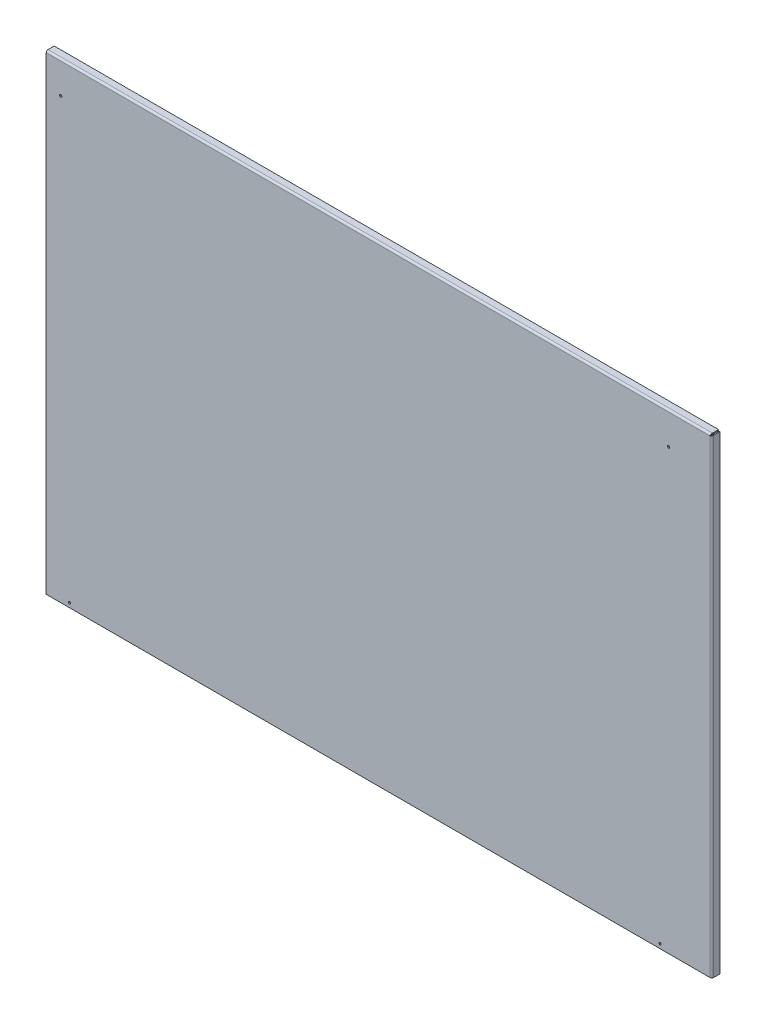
ISO-10303-21;
HEADER;
FILE_DESCRIPTION(('STEP AP214'),'2;1');
FILE_NAME('part.step','',(''),(''),'','','');
FILE_SCHEMA(('AUTOMOTIVE_DESIGN { 1 0 10303 214 1 1 1 1 }'));
ENDSEC;
DATA;
#1=APPLICATION_CONTEXT('core data for automotive mechanical design processes');
#2=APPLICATION_PROTOCOL_DEFINITION('international standard','automotive_design',2000,#1);
#3=PRODUCT_CONTEXT('',#1,'mechanical');
#4=PRODUCT('Part','Part','',(#3));
#5=PRODUCT_RELATED_PRODUCT_CATEGORY('part','',(#4));
#6=PRODUCT_DEFINITION_FORMATION('','',#4);
#7=PRODUCT_DEFINITION_CONTEXT('part definition',#1,'design');
#8=PRODUCT_DEFINITION('design','',#6,#7);
#9=PRODUCT_DEFINITION_SHAPE('','',#8);
#10=(LENGTH_UNIT() NAMED_UNIT(*) SI_UNIT(.MILLI.,.METRE.));
#11=(NAMED_UNIT(*) PLANE_ANGLE_UNIT() SI_UNIT($,.RADIAN.));
#12=(NAMED_UNIT(*) SI_UNIT($,.STERADIAN.) SOLID_ANGLE_UNIT());
#13=UNCERTAINTY_MEASURE_WITH_UNIT(LENGTH_MEASURE(1.E-05),#10,'distance_accuracy_value','');
#14=(GEOMETRIC_REPRESENTATION_CONTEXT(3) GLOBAL_UNCERTAINTY_ASSIGNED_CONTEXT((#13)) GLOBAL_UNIT_ASSIGNED_CONTEXT((#10,
#11,#12)) REPRESENTATION_CONTEXT('',''));
#15=CARTESIAN_POINT('',(0.,0.,0.));
#16=DIRECTION('',(0.,0.,1.));
#17=DIRECTION('',(1.,0.,0.));
#18=AXIS2_PLACEMENT_3D('',#15,#16,#17);
#19=CARTESIAN_POINT('',(0.,0.,-1.5));
#20=DIRECTION('',(0.,0.,1.));
#21=DIRECTION('',(1.,0.,0.));
#22=AXIS2_PLACEMENT_3D('',#19,#20,#21);
#23=PLANE('',#22);
#24=CARTESIAN_POINT('',(-420.,281.1,-1.5));
#25=DIRECTION('',(0.,0.,1.));
#26=DIRECTION('',(1.,0.,0.));
#27=AXIS2_PLACEMENT_3D('',#24,#25,#26);
#28=CIRCLE('',#27,1.50000000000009);
#29=CARTESIAN_POINT('',(-418.5,281.1,-1.5));
#30=VERTEX_POINT('',#29);
#31=EDGE_CURVE('E279',#30,#30,#28,.T.);
#32=ORIENTED_EDGE('',*,*,#31,.T.);
#33=EDGE_LOOP('',(#32));
#34=FACE_BOUND('',#33,.T.);
#35=CARTESIAN_POINT('',(420.,281.1,-1.5));
#36=DIRECTION('',(0.,0.,1.));
#37=DIRECTION('',(1.,0.,0.));
#38=AXIS2_PLACEMENT_3D('',#35,#36,#37);
#39=CIRCLE('',#38,1.50000000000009);
#40=CARTESIAN_POINT('',(421.5,281.1,-1.5));
#41=VERTEX_POINT('',#40);
#42=EDGE_CURVE('E283',#41,#41,#39,.T.);
#43=ORIENTED_EDGE('',*,*,#42,.T.);
#44=EDGE_LOOP('',(#43));
#45=FACE_BOUND('',#44,.T.);
#46=CARTESIAN_POINT('',(-408.,-319.3,-1.5));
#47=DIRECTION('',(0.,0.,1.));
#48=DIRECTION('',(1.,0.,0.));
#49=AXIS2_PLACEMENT_3D('',#46,#47,#48);
#50=CIRCLE('',#49,1.50000000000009);
#51=CARTESIAN_POINT('',(-406.5,-319.3,-1.5));
#52=VERTEX_POINT('',#51);
#53=EDGE_CURVE('E287',#52,#52,#50,.T.);
#54=ORIENTED_EDGE('',*,*,#53,.T.);
#55=EDGE_LOOP('',(#54));
#56=FACE_BOUND('',#55,.T.);
#57=CARTESIAN_POINT('',(408.,-319.3,-1.5));
#58=DIRECTION('',(0.,0.,1.));
#59=DIRECTION('',(1.,0.,0.));
#60=AXIS2_PLACEMENT_3D('',#57,#58,#59);
#61=CIRCLE('',#60,1.50000000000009);
#62=CARTESIAN_POINT('',(409.5,-319.3,-1.5));
#63=VERTEX_POINT('',#62);
#64=EDGE_CURVE('E291',#63,#63,#61,.T.);
#65=ORIENTED_EDGE('',*,*,#64,.T.);
#66=EDGE_LOOP('',(#65));
#67=FACE_BOUND('',#66,.T.);
#68=DIRECTION('',(1.,0.,0.));
#69=VECTOR('',#68,1.);
#70=CARTESIAN_POINT('',(-479.6,-325.3,-1.5));
#71=LINE('',#70,#69);
#72=CARTESIAN_POINT('',(-440.,-325.3,-1.5));
#73=VERTEX_POINT('',#72);
#74=CARTESIAN_POINT('',(477.1,-325.3,-1.49999999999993));
#75=VERTEX_POINT('',#74);
#76=EDGE_CURVE('E13',#73,#75,#71,.T.);
#77=ORIENTED_EDGE('',*,*,#76,.F.);
#78=DIRECTION('',(0.,1.,0.));
#79=VECTOR('',#78,1.);
#80=CARTESIAN_POINT('',(-440.,0.,-1.5));
#81=LINE('',#80,#79);
#82=CARTESIAN_POINT('',(-440.,322.8,-1.50000000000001));
#83=VERTEX_POINT('',#82);
#84=EDGE_CURVE('E296',#73,#83,#81,.T.);
#85=ORIENTED_EDGE('',*,*,#84,.T.);
#86=DIRECTION('',(1.,0.,0.));
#87=VECTOR('',#86,1.);
#88=CARTESIAN_POINT('',(477.958578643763,322.8,-1.50000000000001));
#89=LINE('',#88,#87);
#90=CARTESIAN_POINT('',(477.1,322.8,-1.50000000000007));
#91=VERTEX_POINT('',#90);
#92=EDGE_CURVE('E225',#91,#83,#89,.F.);
#93=ORIENTED_EDGE('',*,*,#92,.F.);
#94=DIRECTION('',(0.,-1.,0.));
#95=VECTOR('',#94,1.);
#96=CARTESIAN_POINT('',(477.1,-325.3,-1.49999999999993));
#97=LINE('',#96,#95);
#98=EDGE_CURVE('E297',#75,#91,#97,.F.);
#99=ORIENTED_EDGE('',*,*,#98,.F.);
#100=EDGE_LOOP('',(#77,#85,#93,#99));
#101=FACE_BOUND('',#100,.T.);
#102=ADVANCED_FACE('F99',(#34,#45,#56,#67,#101),#23,.F.);
#103=CARTESIAN_POINT('',(0.,0.,0.));
#104=DIRECTION('',(0.,0.,1.));
#105=DIRECTION('',(1.,0.,0.));
#106=AXIS2_PLACEMENT_3D('',#103,#104,#105);
#107=PLANE('',#106);
#108=DIRECTION('',(0.,1.,0.));
#109=VECTOR('',#108,1.);
#110=CARTESIAN_POINT('',(-440.,0.,0.));
#111=LINE('',#110,#109);
#112=CARTESIAN_POINT('',(-440.,-325.3,0.));
#113=VERTEX_POINT('',#112);
#114=CARTESIAN_POINT('',(-440.,322.8,0.));
#115=VERTEX_POINT('',#114);
#116=EDGE_CURVE('E429',#113,#115,#111,.T.);
#117=ORIENTED_EDGE('',*,*,#116,.F.);
#118=DIRECTION('',(1.,0.,0.));
#119=VECTOR('',#118,1.);
#120=CARTESIAN_POINT('',(-479.6,-325.3,0.));
#121=LINE('',#120,#119);
#122=CARTESIAN_POINT('',(477.1,-325.3,0.));
#123=VERTEX_POINT('',#122);
#124=EDGE_CURVE('E108',#113,#123,#121,.T.);
#125=ORIENTED_EDGE('',*,*,#124,.T.);
#126=DIRECTION('',(0.,-1.,0.));
#127=VECTOR('',#126,1.);
#128=CARTESIAN_POINT('',(477.1,-325.3,0.));
#129=LINE('',#128,#127);
#130=CARTESIAN_POINT('',(477.1,322.8,0.));
#131=VERTEX_POINT('',#130);
#132=EDGE_CURVE('E329',#123,#131,#129,.F.);
#133=ORIENTED_EDGE('',*,*,#132,.T.);
#134=DIRECTION('',(1.,0.,0.));
#135=VECTOR('',#134,1.);
#136=CARTESIAN_POINT('',(477.958578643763,322.8,0.));
#137=LINE('',#136,#135);
#138=EDGE_CURVE('E230',#131,#115,#137,.F.);
#139=ORIENTED_EDGE('',*,*,#138,.T.);
#140=EDGE_LOOP('',(#117,#125,#133,#139));
#141=FACE_BOUND('',#140,.T.);
#142=CARTESIAN_POINT('',(-420.,281.1,0.));
#143=DIRECTION('',(0.,0.,1.));
#144=DIRECTION('',(1.,0.,0.));
#145=AXIS2_PLACEMENT_3D('',#142,#143,#144);
#146=CIRCLE('',#145,1.50000000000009);
#147=CARTESIAN_POINT('',(-418.5,281.1,0.));
#148=VERTEX_POINT('',#147);
#149=EDGE_CURVE('E103',#148,#148,#146,.T.);
#150=ORIENTED_EDGE('',*,*,#149,.F.);
#151=EDGE_LOOP('',(#150));
#152=FACE_BOUND('',#151,.T.);
#153=CARTESIAN_POINT('',(420.,281.1,0.));
#154=DIRECTION('',(0.,0.,1.));
#155=DIRECTION('',(1.,0.,0.));
#156=AXIS2_PLACEMENT_3D('',#153,#154,#155);
#157=CIRCLE('',#156,1.50000000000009);
#158=CARTESIAN_POINT('',(421.5,281.1,0.));
#159=VERTEX_POINT('',#158);
#160=EDGE_CURVE('E421',#159,#159,#157,.T.);
#161=ORIENTED_EDGE('',*,*,#160,.F.);
#162=EDGE_LOOP('',(#161));
#163=FACE_BOUND('',#162,.T.);
#164=CARTESIAN_POINT('',(-408.,-319.3,0.));
#165=DIRECTION('',(0.,0.,1.));
#166=DIRECTION('',(1.,0.,0.));
#167=AXIS2_PLACEMENT_3D('',#164,#165,#166);
#168=CIRCLE('',#167,1.50000000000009);
#169=CARTESIAN_POINT('',(-406.5,-319.3,0.));
#170=VERTEX_POINT('',#169);
#171=EDGE_CURVE('E423',#170,#170,#168,.T.);
#172=ORIENTED_EDGE('',*,*,#171,.F.);
#173=EDGE_LOOP('',(#172));
#174=FACE_BOUND('',#173,.T.);
#175=CARTESIAN_POINT('',(408.,-319.3,0.));
#176=DIRECTION('',(0.,0.,1.));
#177=DIRECTION('',(1.,0.,0.));
#178=AXIS2_PLACEMENT_3D('',#175,#176,#177);
#179=CIRCLE('',#178,1.50000000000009);
#180=CARTESIAN_POINT('',(409.5,-319.3,0.));
#181=VERTEX_POINT('',#180);
#182=EDGE_CURVE('E425',#181,#181,#179,.T.);
#183=ORIENTED_EDGE('',*,*,#182,.F.);
#184=EDGE_LOOP('',(#183));
#185=FACE_BOUND('',#184,.T.);
#186=ADVANCED_FACE('F270',(#141,#152,#163,#174,#185),#107,.T.);
#187=CARTESIAN_POINT('',(-479.6,-325.3,-1.5));
#188=DIRECTION('',(0.,-1.,0.));
#189=DIRECTION('',(0.,0.,-1.));
#190=AXIS2_PLACEMENT_3D('',#187,#188,#189);
#191=PLANE('',#190);
#192=DIRECTION('',(0.,0.,1.));
#193=VECTOR('',#192,1.);
#194=CARTESIAN_POINT('',(-440.,-325.3,-1.5));
#195=LINE('',#194,#193);
#196=EDGE_CURVE('E303',#73,#113,#195,.T.);
#197=ORIENTED_EDGE('',*,*,#196,.F.);
#198=ORIENTED_EDGE('',*,*,#76,.T.);
#199=DIRECTION('',(0.,0.,1.));
#200=VECTOR('',#199,1.);
#201=CARTESIAN_POINT('',(477.1,-325.3,-1.49999999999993));
#202=LINE('',#201,#200);
#203=EDGE_CURVE('E224',#75,#123,#202,.T.);
#204=ORIENTED_EDGE('',*,*,#203,.T.);
#205=ORIENTED_EDGE('',*,*,#124,.F.);
#206=EDGE_LOOP('',(#197,#198,#204,#205));
#207=FACE_BOUND('',#206,.T.);
#208=ADVANCED_FACE('F101',(#207),#191,.T.);
#209=CARTESIAN_POINT('',(477.958578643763,325.315,-2.49999999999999));
#210=CARTESIAN_POINT('',(477.887018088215,325.315,-2.17073057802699));
#211=CARTESIAN_POINT('',(477.815482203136,325.249541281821,-1.8417040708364));
#212=CARTESIAN_POINT('',(477.672385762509,324.997572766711,-1.23339826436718));
#213=CARTESIAN_POINT('',(477.600837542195,324.811162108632,-0.95441499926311));
#214=CARTESIAN_POINT('',(477.457741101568,324.345585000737,-0.488837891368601));
#215=CARTESIAN_POINT('',(477.386192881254,324.066601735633,-0.302427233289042));
#216=CARTESIAN_POINT('',(477.243096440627,323.458295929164,-0.0504587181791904));
#217=CARTESIAN_POINT('',(477.171560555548,323.129269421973,0.0149999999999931));
#218=CARTESIAN_POINT('',(477.1,322.8,0.0149999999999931));
#219=CARTESIAN_POINT('',(477.958578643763,325.3,-2.49999999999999));
#220=CARTESIAN_POINT('',(477.887018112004,325.3,-2.17269445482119));
#221=CARTESIAN_POINT('',(477.815482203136,325.234931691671,-1.84563028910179));
#222=CARTESIAN_POINT('',(477.672385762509,324.984465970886,-1.24095254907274));
#223=CARTESIAN_POINT('',(477.600837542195,324.799167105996,-0.963633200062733));
#224=CARTESIAN_POINT('',(477.457741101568,324.336366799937,-0.500832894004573));
#225=CARTESIAN_POINT('',(477.386192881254,324.059047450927,-0.315534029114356));
#226=CARTESIAN_POINT('',(477.243096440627,323.454369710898,-0.0650683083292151));
#227=CARTESIAN_POINT('',(477.171560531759,323.127305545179,0.));
#228=CARTESIAN_POINT('',(477.1,322.8,0.));
#229=CARTESIAN_POINT('',(477.958578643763,323.8,-2.5));
#230=CARTESIAN_POINT('',(477.887020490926,323.8,-2.36908213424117));
#231=CARTESIAN_POINT('',(477.815482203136,323.773972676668,-2.23825211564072));
#232=CARTESIAN_POINT('',(477.672385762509,323.673786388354,-1.9963810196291));
#233=CARTESIAN_POINT('',(477.600837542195,323.599666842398,-1.88545328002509));
#234=CARTESIAN_POINT('',(477.457741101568,323.414546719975,-1.70033315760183));
#235=CARTESIAN_POINT('',(477.386192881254,323.303618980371,-1.62621361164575));
#236=CARTESIAN_POINT('',(477.243096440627,323.061747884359,-1.52602732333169));
#237=CARTESIAN_POINT('',(477.171558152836,322.930917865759,-1.50000000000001));
#238=CARTESIAN_POINT('',(477.1,322.8,-1.50000000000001));
#239=CARTESIAN_POINT('',(477.958578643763,323.78485,-2.5));
#240=CARTESIAN_POINT('',(477.887020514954,323.78485,-2.37106564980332));
#241=CARTESIAN_POINT('',(477.815482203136,323.759216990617,-2.24221759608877));
#242=CARTESIAN_POINT('',(477.672385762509,323.660548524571,-2.00401084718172));
#243=CARTESIAN_POINT('',(477.600837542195,323.587551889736,-1.89476366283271));
#244=CARTESIAN_POINT('',(477.457741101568,323.405236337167,-1.71244811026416));
#245=CARTESIAN_POINT('',(477.386192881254,323.295989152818,-1.63945147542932));
#246=CARTESIAN_POINT('',(477.243096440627,323.057782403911,-1.54078300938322));
#247=CARTESIAN_POINT('',(477.171558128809,322.928934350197,-1.51515000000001));
#248=CARTESIAN_POINT('',(477.1,322.8,-1.51515000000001));
#249=B_SPLINE_SURFACE_WITH_KNOTS('',1,3,((#209,#210,#211,#212,#213,#214,#215,#216,#217,#218),
(#219,#220,#221,#222,#223,#224,#225,#226,#227,#228),(#229,#230,#231,#232,#233,#234,#235,#236,
#237,#238),(#239,#240,#241,#242,#243,#244,#245,#246,#247,#248)),.UNSPECIFIED.,.F.,.F.,.F.,(2,1,
1,2),(4,2,2,2,4),(-0.01,0.,1.,1.0101),(0.,0.25,0.5,0.75,1.),.UNSPECIFIED.);
#250=CARTESIAN_POINT('',(477.958578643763,323.8,-2.5));
#251=CARTESIAN_POINT('',(477.938038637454,323.800009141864,-2.46242402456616));
#252=CARTESIAN_POINT('',(477.917500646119,323.797882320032,-2.42485010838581));
#253=CARTESIAN_POINT('',(477.876424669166,323.789424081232,-2.35017596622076));
#254=CARTESIAN_POINT('',(477.855886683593,323.783092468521,-2.31307576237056));
#255=CARTESIAN_POINT('',(477.814858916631,323.766312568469,-2.23991192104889));
#256=CARTESIAN_POINT('',(477.794369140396,323.755874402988,-2.20384596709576));
#257=CARTESIAN_POINT('',(477.753398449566,323.7310270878,-2.13312857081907));
#258=CARTESIAN_POINT('',(477.732917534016,323.716618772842,-2.09847683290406));
#259=CARTESIAN_POINT('',(477.67735968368,323.672369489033,-2.00697056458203));
#260=CARTESIAN_POINT('',(477.642264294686,323.63884162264,-1.95185780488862));
#261=CARTESIAN_POINT('',(477.572112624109,323.561901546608,-1.84913372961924));
#262=CARTESIAN_POINT('',(477.537056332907,323.518496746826,-1.80151683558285));
#263=CARTESIAN_POINT('',(477.466949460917,323.423386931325,-1.71546320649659));
#264=CARTESIAN_POINT('',(477.431898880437,323.371683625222,-1.67702458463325));
#265=CARTESIAN_POINT('',(477.361781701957,323.261860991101,-1.61072965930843));
#266=CARTESIAN_POINT('',(477.326715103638,323.203738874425,-1.58287797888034));
#267=CARTESIAN_POINT('',(477.259694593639,323.088584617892,-1.54076358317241));
#268=CARTESIAN_POINT('',(477.2277407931,323.03191401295,-1.52551378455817));
#269=CARTESIAN_POINT('',(477.179839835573,322.945619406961,-1.51022659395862));
#270=CARTESIAN_POINT('',(477.163874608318,322.916633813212,-1.50639544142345));
#271=CARTESIAN_POINT('',(477.131941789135,322.858435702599,-1.50128162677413));
#272=CARTESIAN_POINT('',(477.115974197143,322.829223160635,-1.49999925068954));
#273=CARTESIAN_POINT('',(477.1,322.8,-1.50000000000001));
#274=B_SPLINE_CURVE_WITH_KNOTS('',3,(#250,#251,#252,#253,#254,#255,#256,#257,#258,#259,#260,
#261,#262,#263,#264,#265,#266,#267,#268,#269,#270,#271,#272,#273),.UNSPECIFIED.,.F.,.F.,(4,2,2,
2,2,2,2,2,2,2,2,4),(0.,0.128412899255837,0.256831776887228,0.384936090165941,0.513013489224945,
0.732204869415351,0.95123234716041,1.17021475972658,1.38929268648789,1.58891634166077,
1.68876822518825,1.78863131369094),.UNSPECIFIED.);
#275=CARTESIAN_POINT('',(477.958578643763,323.8,-2.5));
#276=VERTEX_POINT('',#275);
#277=EDGE_CURVE('E229',#276,#91,#274,.T.);
#278=DIRECTION('',(0.,1.,0.));
#279=VECTOR('',#278,1.);
#280=CARTESIAN_POINT('',(477.958578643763,323.8,-2.5));
#281=LINE('',#280,#279);
#282=CARTESIAN_POINT('',(477.958578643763,325.3,-2.49999999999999));
#283=VERTEX_POINT('',#282);
#284=EDGE_CURVE('E212',#283,#276,#281,.F.);
#285=CARTESIAN_POINT('',(477.958578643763,325.3,-2.49999999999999));
#286=CARTESIAN_POINT('',(477.944918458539,325.300000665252,-2.43752341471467));
#287=CARTESIAN_POINT('',(477.931262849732,325.29765716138,-2.37506713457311));
#288=CARTESIAN_POINT('',(477.903953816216,325.288304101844,-2.25051293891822));
#289=CARTESIAN_POINT('',(477.890300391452,325.281295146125,-2.18841497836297));
#290=CARTESIAN_POINT('',(477.849336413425,325.253308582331,-2.00315044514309));
#291=CARTESIAN_POINT('',(477.822013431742,325.22537124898,-1.88097287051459));
#292=CARTESIAN_POINT('',(477.763226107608,325.145951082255,-1.62408862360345));
#293=CARTESIAN_POINT('',(477.731760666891,325.091545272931,-1.49028327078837));
#294=CARTESIAN_POINT('',(477.668833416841,324.960548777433,-1.23400616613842));
#295=CARTESIAN_POINT('',(477.637371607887,324.88395661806,-1.11153516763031));
#296=CARTESIAN_POINT('',(477.574445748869,324.71087175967,-0.881581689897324));
#297=CARTESIAN_POINT('',(477.542981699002,324.614380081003,-0.774098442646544));
#298=CARTESIAN_POINT('',(477.480051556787,324.404347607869,-0.57729894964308));
#299=CARTESIAN_POINT('',(477.448585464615,324.290804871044,-0.487984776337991));
#300=CARTESIAN_POINT('',(477.385649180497,324.050049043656,-0.330183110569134));
#301=CARTESIAN_POINT('',(477.354178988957,323.922833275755,-0.261699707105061));
#302=CARTESIAN_POINT('',(477.291243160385,323.658544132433,-0.147641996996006));
#303=CARTESIAN_POINT('',(477.259777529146,323.521475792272,-0.10205608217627));
#304=CARTESIAN_POINT('',(477.206924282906,323.286364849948,-0.0458089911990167));
#305=CARTESIAN_POINT('',(477.18552534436,323.189828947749,-0.0286447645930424));
#306=CARTESIAN_POINT('',(477.142754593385,322.995541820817,-0.00573935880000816));
#307=CARTESIAN_POINT('',(477.121382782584,322.897792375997,1.69267853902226E-05));
#308=CARTESIAN_POINT('',(477.1,322.8,0.));
#309=B_SPLINE_CURVE_WITH_KNOTS('',3,(#285,#286,#287,#288,#289,#290,#291,#292,#293,#294,#295,
#296,#297,#298,#299,#300,#301,#302,#303,#304,#305,#306,#307,#308),.UNSPECIFIED.,.F.,.F.,(4,2,2,
2,2,2,2,2,2,2,2,4),(0.,0.191773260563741,0.383521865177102,0.766896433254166,1.20827746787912,
1.64968781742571,2.09107553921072,2.53251357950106,2.97403821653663,3.41533879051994,
3.71579434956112,4.0158517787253),.UNSPECIFIED.);
#310=EDGE_CURVE('E228',#283,#131,#309,.T.);
#311=DIRECTION('',(0.,0.,1.));
#312=VECTOR('',#311,1.);
#313=CARTESIAN_POINT('',(477.1,322.8,-1.50000000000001));
#314=LINE('',#313,#312);
#315=EDGE_CURVE('E233',#91,#131,#314,.T.);
#316=ORIENTED_EDGE('',*,*,#277,.F.);
#317=ORIENTED_EDGE('',*,*,#284,.F.);
#318=ORIENTED_EDGE('',*,*,#310,.T.);
#319=ORIENTED_EDGE('',*,*,#315,.F.);
#320=EDGE_LOOP('',(#316,#317,#318,#319));
#321=FACE_BOUND('',#320,.T.);
#322=ADVANCED_FACE('F248',(#321),#249,.F.);
#323=CARTESIAN_POINT('',(477.958578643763,322.8,-2.50000000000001));
#324=DIRECTION('',(1.,0.,0.));
#325=DIRECTION('',(0.,1.,0.));
#326=AXIS2_PLACEMENT_3D('',#323,#324,#325);
#327=CYLINDRICAL_SURFACE('',#326,2.5);
#328=CARTESIAN_POINT('',(-440.,322.8,-2.50000000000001));
#329=DIRECTION('',(1.,0.,0.));
#330=DIRECTION('',(0.,1.,0.));
#331=AXIS2_PLACEMENT_3D('',#328,#329,#330);
#332=CIRCLE('',#331,2.5);
#333=CARTESIAN_POINT('',(-440.,325.3,-2.50000000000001));
#334=VERTEX_POINT('',#333);
#335=EDGE_CURVE('E427',#115,#334,#332,.F.);
#336=ORIENTED_EDGE('',*,*,#335,.F.);
#337=ORIENTED_EDGE('',*,*,#138,.F.);
#338=ORIENTED_EDGE('',*,*,#310,.F.);
#339=DIRECTION('',(1.,0.,0.));
#340=VECTOR('',#339,1.);
#341=CARTESIAN_POINT('',(0.,325.3,-2.49999999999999));
#342=LINE('',#341,#340);
#343=EDGE_CURVE('E210',#334,#283,#342,.T.);
#344=ORIENTED_EDGE('',*,*,#343,.F.);
#345=EDGE_LOOP('',(#336,#337,#338,#344));
#346=FACE_BOUND('',#345,.T.);
#347=ADVANCED_FACE('F253',(#346),#327,.T.);
#348=CARTESIAN_POINT('',(477.958578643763,322.8,-2.50000000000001));
#349=DIRECTION('',(1.,0.,0.));
#350=DIRECTION('',(0.,1.,0.));
#351=AXIS2_PLACEMENT_3D('',#348,#349,#350);
#352=CYLINDRICAL_SURFACE('',#351,1.);
#353=ORIENTED_EDGE('',*,*,#92,.T.);
#354=CARTESIAN_POINT('',(-440.,322.8,-2.50000000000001));
#355=DIRECTION('',(1.,0.,0.));
#356=DIRECTION('',(0.,1.,0.));
#357=AXIS2_PLACEMENT_3D('',#354,#355,#356);
#358=CIRCLE('',#357,1.);
#359=CARTESIAN_POINT('',(-440.,323.8,-2.5));
#360=VERTEX_POINT('',#359);
#361=EDGE_CURVE('E203',#83,#360,#358,.F.);
#362=ORIENTED_EDGE('',*,*,#361,.T.);
#363=DIRECTION('',(-1.,0.,0.));
#364=VECTOR('',#363,1.);
#365=CARTESIAN_POINT('',(-479.6,323.8,-2.5));
#366=LINE('',#365,#364);
#367=EDGE_CURVE('E202',#360,#276,#366,.F.);
#368=ORIENTED_EDGE('',*,*,#367,.T.);
#369=ORIENTED_EDGE('',*,*,#277,.T.);
#370=EDGE_LOOP('',(#353,#362,#368,#369));
#371=FACE_BOUND('',#370,.T.);
#372=ADVANCED_FACE('F257',(#371),#352,.F.);
#373=CARTESIAN_POINT('',(0.,325.3,1.90605590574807E-12));
#374=DIRECTION('',(0.,1.,0.));
#375=DIRECTION('',(0.,0.,1.));
#376=AXIS2_PLACEMENT_3D('',#373,#374,#375);
#377=PLANE('',#376);
#378=DIRECTION('',(0.,0.,-1.));
#379=VECTOR('',#378,1.);
#380=CARTESIAN_POINT('',(-440.,325.3,1.90605590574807E-12));
#381=LINE('',#380,#379);
#382=CARTESIAN_POINT('',(-440.,325.3,-11.));
#383=VERTEX_POINT('',#382);
#384=EDGE_CURVE('E116',#334,#383,#381,.T.);
#385=ORIENTED_EDGE('',*,*,#384,.F.);
#386=ORIENTED_EDGE('',*,*,#343,.T.);
#387=DIRECTION('',(0.,0.,-1.));
#388=VECTOR('',#387,1.);
#389=CARTESIAN_POINT('',(477.958578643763,325.3,-1.49999999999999));
#390=LINE('',#389,#388);
#391=CARTESIAN_POINT('',(477.958578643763,325.3,-11.));
#392=VERTEX_POINT('',#391);
#393=EDGE_CURVE('E219',#392,#283,#390,.F.);
#394=ORIENTED_EDGE('',*,*,#393,.F.);
#395=DIRECTION('',(1.,0.,0.));
#396=VECTOR('',#395,1.);
#397=CARTESIAN_POINT('',(479.6,325.3,-11.));
#398=LINE('',#397,#396);
#399=EDGE_CURVE('E209',#383,#392,#398,.T.);
#400=ORIENTED_EDGE('',*,*,#399,.F.);
#401=EDGE_LOOP('',(#385,#386,#394,#400));
#402=FACE_BOUND('',#401,.T.);
#403=ADVANCED_FACE('F262',(#402),#377,.T.);
#404=CARTESIAN_POINT('',(0.,323.8,1.90081868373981E-12));
#405=DIRECTION('',(0.,1.,0.));
#406=DIRECTION('',(0.,0.,1.));
#407=AXIS2_PLACEMENT_3D('',#404,#405,#406);
#408=PLANE('',#407);
#409=ORIENTED_EDGE('',*,*,#367,.F.);
#410=DIRECTION('',(0.,0.,-1.));
#411=VECTOR('',#410,1.);
#412=CARTESIAN_POINT('',(-440.,323.8,1.90081868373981E-12));
#413=LINE('',#412,#411);
#414=CARTESIAN_POINT('',(-440.,323.8,-11.));
#415=VERTEX_POINT('',#414);
#416=EDGE_CURVE('E190',#360,#415,#413,.T.);
#417=ORIENTED_EDGE('',*,*,#416,.T.);
#418=DIRECTION('',(-1.,0.,0.));
#419=VECTOR('',#418,1.);
#420=CARTESIAN_POINT('',(0.,323.8,-11.));
#421=LINE('',#420,#419);
#422=CARTESIAN_POINT('',(477.958578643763,323.8,-11.));
#423=VERTEX_POINT('',#422);
#424=EDGE_CURVE('E200',#415,#423,#421,.F.);
#425=ORIENTED_EDGE('',*,*,#424,.T.);
#426=DIRECTION('',(0.,0.,-1.));
#427=VECTOR('',#426,1.);
#428=CARTESIAN_POINT('',(477.958578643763,323.8,-1.5));
#429=LINE('',#428,#427);
#430=EDGE_CURVE('E222',#276,#423,#429,.T.);
#431=ORIENTED_EDGE('',*,*,#430,.F.);
#432=EDGE_LOOP('',(#409,#417,#425,#431));
#433=FACE_BOUND('',#432,.T.);
#434=ADVANCED_FACE('F198',(#433),#408,.F.);
#435=CARTESIAN_POINT('',(479.6,325.3,-11.));
#436=DIRECTION('',(0.,0.,-1.));
#437=DIRECTION('',(0.,1.,0.));
#438=AXIS2_PLACEMENT_3D('',#435,#436,#437);
#439=PLANE('',#438);
#440=DIRECTION('',(0.,1.,0.));
#441=VECTOR('',#440,1.);
#442=CARTESIAN_POINT('',(-440.,525.3,-11.));
#443=LINE('',#442,#441);
#444=EDGE_CURVE('E187',#415,#383,#443,.T.);
#445=ORIENTED_EDGE('',*,*,#444,.T.);
#446=ORIENTED_EDGE('',*,*,#399,.T.);
#447=DIRECTION('',(0.,-1.,0.));
#448=VECTOR('',#447,1.);
#449=CARTESIAN_POINT('',(477.958578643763,323.8,-11.));
#450=LINE('',#449,#448);
#451=EDGE_CURVE('E207',#423,#392,#450,.F.);
#452=ORIENTED_EDGE('',*,*,#451,.F.);
#453=ORIENTED_EDGE('',*,*,#424,.F.);
#454=EDGE_LOOP('',(#445,#446,#452,#453));
#455=FACE_BOUND('',#454,.T.);
#456=ADVANCED_FACE('F205',(#455),#439,.T.);
#457=CARTESIAN_POINT('',(477.958578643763,323.8,-1.5));
#458=DIRECTION('',(-1.,0.,0.));
#459=DIRECTION('',(0.,0.,1.));
#460=AXIS2_PLACEMENT_3D('',#457,#458,#459);
#461=PLANE('',#460);
#462=ORIENTED_EDGE('',*,*,#430,.T.);
#463=ORIENTED_EDGE('',*,*,#451,.T.);
#464=ORIENTED_EDGE('',*,*,#393,.T.);
#465=ORIENTED_EDGE('',*,*,#284,.T.);
#466=EDGE_LOOP('',(#462,#463,#464,#465));
#467=FACE_BOUND('',#466,.T.);
#468=ADVANCED_FACE('F484',(#467),#461,.F.);
#469=CARTESIAN_POINT('',(477.1,322.8,0.0149999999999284));
#470=CARTESIAN_POINT('',(477.429269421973,322.871560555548,0.0149999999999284));
#471=CARTESIAN_POINT('',(477.758295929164,322.943096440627,-0.0504587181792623));
#472=CARTESIAN_POINT('',(478.366601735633,323.086192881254,-0.302427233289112));
#473=CARTESIAN_POINT('',(478.645585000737,323.157741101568,-0.488837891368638));
#474=CARTESIAN_POINT('',(479.111162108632,323.300837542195,-0.954414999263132));
#475=CARTESIAN_POINT('',(479.297572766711,323.372385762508,-1.2333982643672));
#476=CARTESIAN_POINT('',(479.549541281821,323.515482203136,-1.84170407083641));
#477=CARTESIAN_POINT('',(479.615,323.587018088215,-2.17073057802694));
#478=CARTESIAN_POINT('',(479.615,323.658578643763,-2.49999999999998));
#479=CARTESIAN_POINT('',(477.1,322.8,0.));
#480=CARTESIAN_POINT('',(477.427305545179,322.871560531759,0.));
#481=CARTESIAN_POINT('',(477.754369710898,322.943096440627,-0.065068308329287));
#482=CARTESIAN_POINT('',(478.359047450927,323.086192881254,-0.315534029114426));
#483=CARTESIAN_POINT('',(478.636366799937,323.157741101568,-0.500832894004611));
#484=CARTESIAN_POINT('',(479.099167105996,323.300837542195,-0.963633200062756));
#485=CARTESIAN_POINT('',(479.284465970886,323.372385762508,-1.24095254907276));
#486=CARTESIAN_POINT('',(479.534931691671,323.515482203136,-1.84563028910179));
#487=CARTESIAN_POINT('',(479.6,323.587018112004,-2.17269445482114));
#488=CARTESIAN_POINT('',(479.6,323.658578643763,-2.49999999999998));
#489=CARTESIAN_POINT('',(477.1,322.8,-1.50000000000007));
#490=CARTESIAN_POINT('',(477.230917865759,322.871558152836,-1.50000000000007));
#491=CARTESIAN_POINT('',(477.361747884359,322.943096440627,-1.52602732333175));
#492=CARTESIAN_POINT('',(477.603618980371,323.086192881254,-1.6262136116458));
#493=CARTESIAN_POINT('',(477.714546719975,323.157741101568,-1.70033315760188));
#494=CARTESIAN_POINT('',(477.899666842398,323.300837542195,-1.88545328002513));
#495=CARTESIAN_POINT('',(477.973786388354,323.372385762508,-1.99638101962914));
#496=CARTESIAN_POINT('',(478.073972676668,323.515482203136,-2.23825211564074));
#497=CARTESIAN_POINT('',(478.1,323.587020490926,-2.36908213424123));
#498=CARTESIAN_POINT('',(478.1,323.658578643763,-2.5));
#499=CARTESIAN_POINT('',(477.1,322.8,-1.51515000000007));
#500=CARTESIAN_POINT('',(477.228934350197,322.871558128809,-1.51515000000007));
#501=CARTESIAN_POINT('',(477.357782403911,322.943096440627,-1.54078300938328));
#502=CARTESIAN_POINT('',(477.595989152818,323.086192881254,-1.63945147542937));
#503=CARTESIAN_POINT('',(477.705236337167,323.157741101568,-1.71244811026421));
#504=CARTESIAN_POINT('',(477.887551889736,323.300837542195,-1.89476366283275));
#505=CARTESIAN_POINT('',(477.960548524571,323.372385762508,-2.00401084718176));
#506=CARTESIAN_POINT('',(478.059216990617,323.515482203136,-2.24221759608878));
#507=CARTESIAN_POINT('',(478.08485,323.587020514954,-2.37106564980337));
#508=CARTESIAN_POINT('',(478.08485,323.658578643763,-2.5));
#509=B_SPLINE_SURFACE_WITH_KNOTS('',1,3,((#469,#470,#471,#472,#473,#474,#475,#476,#477,#478),
(#479,#480,#481,#482,#483,#484,#485,#486,#487,#488),(#489,#490,#491,#492,#493,#494,#495,#496,
#497,#498),(#499,#500,#501,#502,#503,#504,#505,#506,#507,#508)),.UNSPECIFIED.,.F.,.F.,.F.,(2,1,
1,2),(4,2,2,2,4),(-0.01,0.,1.,1.0101),(0.,0.25,0.5,0.75,1.),.UNSPECIFIED.);
#510=DIRECTION('',(-1.,0.,0.));
#511=VECTOR('',#510,1.);
#512=CARTESIAN_POINT('',(478.1,323.658578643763,-2.5));
#513=LINE('',#512,#511);
#514=CARTESIAN_POINT('',(479.6,323.658578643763,-2.50000000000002));
#515=VERTEX_POINT('',#514);
#516=CARTESIAN_POINT('',(478.1,323.658578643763,-2.50000000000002));
#517=VERTEX_POINT('',#516);
#518=EDGE_CURVE('E320',#515,#517,#513,.T.);
#519=CARTESIAN_POINT('',(477.1,322.8,-1.50000000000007));
#520=CARTESIAN_POINT('',(477.137575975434,322.820540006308,-1.49999085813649));
#521=CARTESIAN_POINT('',(477.175149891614,322.841077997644,-1.50211767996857));
#522=CARTESIAN_POINT('',(477.249824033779,322.882153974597,-1.51057591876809));
#523=CARTESIAN_POINT('',(477.28692423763,322.902691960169,-1.51690753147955));
#524=CARTESIAN_POINT('',(477.360088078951,322.943719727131,-1.53368743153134));
#525=CARTESIAN_POINT('',(477.396154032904,322.964209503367,-1.54412559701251));
#526=CARTESIAN_POINT('',(477.466871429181,323.005180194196,-1.56897291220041));
#527=CARTESIAN_POINT('',(477.501523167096,323.025661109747,-1.58338122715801));
#528=CARTESIAN_POINT('',(477.593029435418,323.081218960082,-1.62763051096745));
#529=CARTESIAN_POINT('',(477.648142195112,323.116314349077,-1.66115837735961));
#530=CARTESIAN_POINT('',(477.750866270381,323.186466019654,-1.73809845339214));
#531=CARTESIAN_POINT('',(477.798483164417,323.221522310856,-1.78150325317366));
#532=CARTESIAN_POINT('',(477.884536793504,323.291629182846,-1.87661306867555));
#533=CARTESIAN_POINT('',(477.922975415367,323.326679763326,-1.92831637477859));
#534=CARTESIAN_POINT('',(477.989270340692,323.396796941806,-2.0381390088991));
#535=CARTESIAN_POINT('',(478.01712202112,323.431863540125,-2.09626112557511));
#536=CARTESIAN_POINT('',(478.059236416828,323.498884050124,-2.21141538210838));
#537=CARTESIAN_POINT('',(478.074486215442,323.530837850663,-2.26808598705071));
#538=CARTESIAN_POINT('',(478.089773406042,323.578738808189,-2.35438059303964));
#539=CARTESIAN_POINT('',(478.093604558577,323.594704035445,-2.38336618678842));
#540=CARTESIAN_POINT('',(478.098718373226,323.626636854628,-2.44156429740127));
#541=CARTESIAN_POINT('',(478.100000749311,323.64260444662,-2.47077683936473));
#542=CARTESIAN_POINT('',(478.1,323.658578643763,-2.5));
#543=B_SPLINE_CURVE_WITH_KNOTS('',3,(#519,#520,#521,#522,#523,#524,#525,#526,#527,#528,#529,
#530,#531,#532,#533,#534,#535,#536,#537,#538,#539,#540,#541,#542),.UNSPECIFIED.,.F.,.F.,(4,2,2,
2,2,2,2,2,2,2,2,4),(0.,0.128412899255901,0.256831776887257,0.38493609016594,0.513013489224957,
0.732204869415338,0.951232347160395,1.17021475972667,1.38929268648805,1.58891634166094,
1.68876822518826,1.78863131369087),.UNSPECIFIED.);
#544=EDGE_CURVE('E322',#91,#517,#543,.T.);
#545=CARTESIAN_POINT('',(477.1,322.8,0.));
#546=CARTESIAN_POINT('',(477.162476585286,322.813660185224,6.65252070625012E-07));
#547=CARTESIAN_POINT('',(477.224932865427,322.827315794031,-0.00234283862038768));
#548=CARTESIAN_POINT('',(477.349487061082,322.854624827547,-0.0116958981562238));
#549=CARTESIAN_POINT('',(477.411585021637,322.868278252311,-0.0187048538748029));
#550=CARTESIAN_POINT('',(477.596849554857,322.909242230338,-0.0466914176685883));
#551=CARTESIAN_POINT('',(477.719027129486,322.936565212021,-0.0746287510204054));
#552=CARTESIAN_POINT('',(477.975911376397,322.995352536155,-0.154048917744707));
#553=CARTESIAN_POINT('',(478.109716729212,323.026817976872,-0.208454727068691));
#554=CARTESIAN_POINT('',(478.365993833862,323.089745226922,-0.339451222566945));
#555=CARTESIAN_POINT('',(478.48846483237,323.121207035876,-0.416043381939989));
#556=CARTESIAN_POINT('',(478.718418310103,323.184132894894,-0.589128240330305));
#557=CARTESIAN_POINT('',(478.825901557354,323.215596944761,-0.685619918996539));
#558=CARTESIAN_POINT('',(479.022701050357,323.278527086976,-0.895652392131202));
#559=CARTESIAN_POINT('',(479.112015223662,323.309993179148,-1.00919512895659));
#560=CARTESIAN_POINT('',(479.269816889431,323.372929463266,-1.24995095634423));
#561=CARTESIAN_POINT('',(479.338300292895,323.404399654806,-1.37716672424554));
#562=CARTESIAN_POINT('',(479.452358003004,323.467335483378,-1.641455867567));
#563=CARTESIAN_POINT('',(479.497943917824,323.498801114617,-1.77852420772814));
#564=CARTESIAN_POINT('',(479.554191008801,323.551654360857,-2.01363515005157));
#565=CARTESIAN_POINT('',(479.571355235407,323.573053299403,-2.11017105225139));
#566=CARTESIAN_POINT('',(479.5942606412,323.615824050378,-2.30445817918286));
#567=CARTESIAN_POINT('',(479.600016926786,323.637195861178,-2.40220762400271));
#568=CARTESIAN_POINT('',(479.6,323.658578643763,-2.49999999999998));
#569=B_SPLINE_CURVE_WITH_KNOTS('',3,(#545,#546,#547,#548,#549,#550,#551,#552,#553,#554,#555,
#556,#557,#558,#559,#560,#561,#562,#563,#564,#565,#566,#567,#568),.UNSPECIFIED.,.F.,.F.,(4,2,2,
2,2,2,2,2,2,2,2,4),(0.,0.191773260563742,0.383521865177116,0.766896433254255,1.2082774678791,
1.64968781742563,2.09107553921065,2.532513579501,2.97403821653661,3.41533879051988,
3.71579434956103,4.01585177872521),.UNSPECIFIED.);
#570=EDGE_CURVE('E125',#131,#515,#569,.T.);
#571=ORIENTED_EDGE('',*,*,#518,.T.);
#572=ORIENTED_EDGE('',*,*,#544,.F.);
#573=ORIENTED_EDGE('',*,*,#315,.T.);
#574=ORIENTED_EDGE('',*,*,#570,.T.);
#575=EDGE_LOOP('',(#571,#572,#573,#574));
#576=FACE_BOUND('',#575,.T.);
#577=ADVANCED_FACE('F344',(#576),#509,.F.);
#578=CARTESIAN_POINT('',(477.1,-325.3,-2.49999999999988));
#579=DIRECTION('',(0.,1.,0.));
#580=DIRECTION('',(0.,0.,1.));
#581=AXIS2_PLACEMENT_3D('',#578,#579,#580);
#582=PLANE('',#581);
#583=CARTESIAN_POINT('',(477.1,-325.3,-2.49999999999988));
#584=DIRECTION('',(0.,-1.,0.));
#585=DIRECTION('',(0.,0.,-1.));
#586=AXIS2_PLACEMENT_3D('',#583,#584,#585);
#587=CIRCLE('',#586,0.999999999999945);
#588=CARTESIAN_POINT('',(478.1,-325.3,-2.49999999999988));
#589=VERTEX_POINT('',#588);
#590=EDGE_CURVE('E310',#589,#75,#587,.T.);
#591=ORIENTED_EDGE('',*,*,#590,.F.);
#592=DIRECTION('',(1.,0.,0.));
#593=VECTOR('',#592,1.);
#594=CARTESIAN_POINT('',(478.1,-325.3,-2.49999999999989));
#595=LINE('',#594,#593);
#596=CARTESIAN_POINT('',(479.6,-325.3,-2.49999999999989));
#597=VERTEX_POINT('',#596);
#598=EDGE_CURVE('E391',#589,#597,#595,.T.);
#599=ORIENTED_EDGE('',*,*,#598,.T.);
#600=CARTESIAN_POINT('',(477.1,-325.3,-2.49999999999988));
#601=DIRECTION('',(0.,-1.,0.));
#602=DIRECTION('',(0.,0.,-1.));
#603=AXIS2_PLACEMENT_3D('',#600,#601,#602);
#604=CIRCLE('',#603,2.49999999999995);
#605=EDGE_CURVE('E312',#597,#123,#604,.T.);
#606=ORIENTED_EDGE('',*,*,#605,.T.);
#607=ORIENTED_EDGE('',*,*,#203,.F.);
#608=EDGE_LOOP('',(#591,#599,#606,#607));
#609=FACE_BOUND('',#608,.T.);
#610=ADVANCED_FACE('F308',(#609),#582,.F.);
#611=CARTESIAN_POINT('',(477.1,-325.3,-2.49999999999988));
#612=DIRECTION('',(0.,-1.,0.));
#613=DIRECTION('',(1.,0.,0.));
#614=AXIS2_PLACEMENT_3D('',#611,#612,#613);
#615=CYLINDRICAL_SURFACE('',#614,2.49999999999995);
#616=ORIENTED_EDGE('',*,*,#132,.F.);
#617=ORIENTED_EDGE('',*,*,#605,.F.);
#618=DIRECTION('',(0.,-1.,0.));
#619=VECTOR('',#618,1.);
#620=CARTESIAN_POINT('',(479.6,325.3,-2.5));
#621=LINE('',#620,#619);
#622=EDGE_CURVE('E405',#597,#515,#621,.F.);
#623=ORIENTED_EDGE('',*,*,#622,.T.);
#624=ORIENTED_EDGE('',*,*,#570,.F.);
#625=EDGE_LOOP('',(#616,#617,#623,#624));
#626=FACE_BOUND('',#625,.T.);
#627=ADVANCED_FACE('F349',(#626),#615,.T.);
#628=CARTESIAN_POINT('',(477.1,-325.3,-2.49999999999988));
#629=DIRECTION('',(0.,-1.,0.));
#630=DIRECTION('',(1.,0.,0.));
#631=AXIS2_PLACEMENT_3D('',#628,#629,#630);
#632=CYLINDRICAL_SURFACE('',#631,0.999999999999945);
#633=ORIENTED_EDGE('',*,*,#98,.T.);
#634=ORIENTED_EDGE('',*,*,#544,.T.);
#635=DIRECTION('',(0.,-1.,0.));
#636=VECTOR('',#635,1.);
#637=CARTESIAN_POINT('',(478.1,325.3,-2.5));
#638=LINE('',#637,#636);
#639=EDGE_CURVE('E319',#517,#589,#638,.T.);
#640=ORIENTED_EDGE('',*,*,#639,.T.);
#641=ORIENTED_EDGE('',*,*,#590,.T.);
#642=EDGE_LOOP('',(#633,#634,#640,#641));
#643=FACE_BOUND('',#642,.T.);
#644=ADVANCED_FACE('F315',(#643),#632,.F.);
#645=CARTESIAN_POINT('',(478.1,323.658578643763,-1.5));
#646=DIRECTION('',(0.,1.,0.));
#647=DIRECTION('',(0.,0.,1.));
#648=AXIS2_PLACEMENT_3D('',#645,#646,#647);
#649=PLANE('',#648);
#650=DIRECTION('',(1.,0.,0.));
#651=VECTOR('',#650,1.);
#652=CARTESIAN_POINT('',(479.6,323.658578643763,-11.));
#653=LINE('',#652,#651);
#654=CARTESIAN_POINT('',(478.1,323.658578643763,-11.));
#655=VERTEX_POINT('',#654);
#656=CARTESIAN_POINT('',(479.6,323.658578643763,-11.));
#657=VERTEX_POINT('',#656);
#658=EDGE_CURVE('E409',#655,#657,#653,.T.);
#659=ORIENTED_EDGE('',*,*,#658,.F.);
#660=DIRECTION('',(0.,0.,-1.));
#661=VECTOR('',#660,1.);
#662=CARTESIAN_POINT('',(478.1,323.658578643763,2.26009577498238E-12));
#663=LINE('',#662,#661);
#664=EDGE_CURVE('E413',#517,#655,#663,.T.);
#665=ORIENTED_EDGE('',*,*,#664,.F.);
#666=ORIENTED_EDGE('',*,*,#518,.F.);
#667=DIRECTION('',(0.,0.,1.));
#668=VECTOR('',#667,1.);
#669=CARTESIAN_POINT('',(479.6,323.658578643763,-1.5));
#670=LINE('',#669,#668);
#671=EDGE_CURVE('E412',#515,#657,#670,.F.);
#672=ORIENTED_EDGE('',*,*,#671,.T.);
#673=EDGE_LOOP('',(#659,#665,#666,#672));
#674=FACE_BOUND('',#673,.T.);
#675=ADVANCED_FACE('F357',(#674),#649,.T.);
#676=CARTESIAN_POINT('',(479.6,0.,0.));
#677=DIRECTION('',(-1.,0.,0.));
#678=DIRECTION('',(0.,-1.,0.));
#679=AXIS2_PLACEMENT_3D('',#676,#677,#678);
#680=PLANE('',#679);
#681=ORIENTED_EDGE('',*,*,#671,.F.);
#682=ORIENTED_EDGE('',*,*,#622,.F.);
#683=DIRECTION('',(0.,0.,-1.));
#684=VECTOR('',#683,1.);
#685=CARTESIAN_POINT('',(479.6,-325.3,-10.9999999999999));
#686=LINE('',#685,#684);
#687=CARTESIAN_POINT('',(479.6,-325.3,-10.9999999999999));
#688=VERTEX_POINT('',#687);
#689=EDGE_CURVE('E389',#688,#597,#686,.F.);
#690=ORIENTED_EDGE('',*,*,#689,.F.);
#691=DIRECTION('',(0.,1.,0.));
#692=VECTOR('',#691,1.);
#693=CARTESIAN_POINT('',(479.6,325.3,-11.));
#694=LINE('',#693,#692);
#695=EDGE_CURVE('E396',#657,#688,#694,.F.);
#696=ORIENTED_EDGE('',*,*,#695,.F.);
#697=EDGE_LOOP('',(#681,#682,#690,#696));
#698=FACE_BOUND('',#697,.T.);
#699=ADVANCED_FACE('F361',(#698),#680,.F.);
#700=CARTESIAN_POINT('',(478.1,0.,0.));
#701=DIRECTION('',(-1.,0.,0.));
#702=DIRECTION('',(0.,-1.,0.));
#703=AXIS2_PLACEMENT_3D('',#700,#701,#702);
#704=PLANE('',#703);
#705=ORIENTED_EDGE('',*,*,#639,.F.);
#706=ORIENTED_EDGE('',*,*,#664,.T.);
#707=DIRECTION('',(0.,-1.,0.));
#708=VECTOR('',#707,1.);
#709=CARTESIAN_POINT('',(478.1,0.,-11.));
#710=LINE('',#709,#708);
#711=CARTESIAN_POINT('',(478.1,-325.3,-10.9999999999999));
#712=VERTEX_POINT('',#711);
#713=EDGE_CURVE('E403',#655,#712,#710,.T.);
#714=ORIENTED_EDGE('',*,*,#713,.T.);
#715=DIRECTION('',(0.,0.,1.));
#716=VECTOR('',#715,1.);
#717=CARTESIAN_POINT('',(478.1,-325.3,0.));
#718=LINE('',#717,#716);
#719=EDGE_CURVE('E399',#712,#589,#718,.T.);
#720=ORIENTED_EDGE('',*,*,#719,.T.);
#721=EDGE_LOOP('',(#705,#706,#714,#720));
#722=FACE_BOUND('',#721,.T.);
#723=ADVANCED_FACE('F367',(#722),#704,.T.);
#724=CARTESIAN_POINT('',(479.6,325.3,-11.));
#725=DIRECTION('',(0.,0.,-1.));
#726=DIRECTION('',(-1.,0.,0.));
#727=AXIS2_PLACEMENT_3D('',#724,#725,#726);
#728=PLANE('',#727);
#729=ORIENTED_EDGE('',*,*,#713,.F.);
#730=ORIENTED_EDGE('',*,*,#658,.T.);
#731=ORIENTED_EDGE('',*,*,#695,.T.);
#732=DIRECTION('',(-1.,0.,0.));
#733=VECTOR('',#732,1.);
#734=CARTESIAN_POINT('',(479.6,-325.3,-10.9999999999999));
#735=LINE('',#734,#733);
#736=EDGE_CURVE('E324',#688,#712,#735,.T.);
#737=ORIENTED_EDGE('',*,*,#736,.T.);
#738=EDGE_LOOP('',(#729,#730,#731,#737));
#739=FACE_BOUND('',#738,.T.);
#740=ADVANCED_FACE('F353',(#739),#728,.T.);
#741=CARTESIAN_POINT('',(479.6,-325.3,-10.9999999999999));
#742=DIRECTION('',(0.,-1.,0.));
#743=DIRECTION('',(1.,0.,0.));
#744=AXIS2_PLACEMENT_3D('',#741,#742,#743);
#745=PLANE('',#744);
#746=ORIENTED_EDGE('',*,*,#689,.T.);
#747=ORIENTED_EDGE('',*,*,#598,.F.);
#748=ORIENTED_EDGE('',*,*,#719,.F.);
#749=ORIENTED_EDGE('',*,*,#736,.F.);
#750=EDGE_LOOP('',(#746,#747,#748,#749));
#751=FACE_BOUND('',#750,.T.);
#752=ADVANCED_FACE('F376',(#751),#745,.T.);
#753=CARTESIAN_POINT('',(408.,-319.3,-11.));
#754=DIRECTION('',(0.,0.,1.));
#755=DIRECTION('',(1.,0.,0.));
#756=AXIS2_PLACEMENT_3D('',#753,#754,#755);
#757=CYLINDRICAL_SURFACE('',#756,1.50000000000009);
#758=ORIENTED_EDGE('',*,*,#182,.T.);
#759=EDGE_LOOP('',(#758));
#760=FACE_BOUND('',#759,.T.);
#761=ORIENTED_EDGE('',*,*,#64,.F.);
#762=EDGE_LOOP('',(#761));
#763=FACE_BOUND('',#762,.T.);
#764=ADVANCED_FACE('F371',(#760,#763),#757,.F.);
#765=CARTESIAN_POINT('',(-408.,-319.3,-11.));
#766=DIRECTION('',(0.,0.,1.));
#767=DIRECTION('',(1.,0.,0.));
#768=AXIS2_PLACEMENT_3D('',#765,#766,#767);
#769=CYLINDRICAL_SURFACE('',#768,1.50000000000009);
#770=ORIENTED_EDGE('',*,*,#171,.T.);
#771=EDGE_LOOP('',(#770));
#772=FACE_BOUND('',#771,.T.);
#773=ORIENTED_EDGE('',*,*,#53,.F.);
#774=EDGE_LOOP('',(#773));
#775=FACE_BOUND('',#774,.T.);
#776=ADVANCED_FACE('F383',(#772,#775),#769,.F.);
#777=CARTESIAN_POINT('',(420.,281.1,-11.));
#778=DIRECTION('',(0.,0.,1.));
#779=DIRECTION('',(1.,0.,0.));
#780=AXIS2_PLACEMENT_3D('',#777,#778,#779);
#781=CYLINDRICAL_SURFACE('',#780,1.50000000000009);
#782=ORIENTED_EDGE('',*,*,#160,.T.);
#783=EDGE_LOOP('',(#782));
#784=FACE_BOUND('',#783,.T.);
#785=ORIENTED_EDGE('',*,*,#42,.F.);
#786=EDGE_LOOP('',(#785));
#787=FACE_BOUND('',#786,.T.);
#788=ADVANCED_FACE('F447',(#784,#787),#781,.F.);
#789=CARTESIAN_POINT('',(-420.,281.1,-11.));
#790=DIRECTION('',(0.,0.,1.));
#791=DIRECTION('',(1.,0.,0.));
#792=AXIS2_PLACEMENT_3D('',#789,#790,#791);
#793=CYLINDRICAL_SURFACE('',#792,1.50000000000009);
#794=ORIENTED_EDGE('',*,*,#149,.T.);
#795=EDGE_LOOP('',(#794));
#796=FACE_BOUND('',#795,.T.);
#797=ORIENTED_EDGE('',*,*,#31,.F.);
#798=EDGE_LOOP('',(#797));
#799=FACE_BOUND('',#798,.T.);
#800=ADVANCED_FACE('F462',(#796,#799),#793,.F.);
#801=CARTESIAN_POINT('',(-440.,525.3,-11.));
#802=DIRECTION('',(1.,0.,0.));
#803=DIRECTION('',(0.,1.,0.));
#804=AXIS2_PLACEMENT_3D('',#801,#802,#803);
#805=PLANE('',#804);
#806=ORIENTED_EDGE('',*,*,#384,.T.);
#807=ORIENTED_EDGE('',*,*,#444,.F.);
#808=ORIENTED_EDGE('',*,*,#416,.F.);
#809=ORIENTED_EDGE('',*,*,#361,.F.);
#810=ORIENTED_EDGE('',*,*,#84,.F.);
#811=ORIENTED_EDGE('',*,*,#196,.T.);
#812=ORIENTED_EDGE('',*,*,#116,.T.);
#813=ORIENTED_EDGE('',*,*,#335,.T.);
#814=EDGE_LOOP('',(#806,#807,#808,#809,#810,#811,#812,#813));
#815=FACE_BOUND('',#814,.T.);
#816=ADVANCED_FACE('F189',(#815),#805,.F.);
#817=CLOSED_SHELL('',(#102,#186,#208,#322,#347,#372,#403,#434,#456,#468,#577,#610,#627,#644,
#675,#699,#723,#740,#752,#764,#776,#788,#800,#816));
#818=MANIFOLD_SOLID_BREP('B2',#817);
#819=ADVANCED_BREP_SHAPE_REPRESENTATION('',(#18,#818),#14);
#820=SHAPE_DEFINITION_REPRESENTATION(#9,#819);
ENDSEC;
END-ISO-10303-21;
